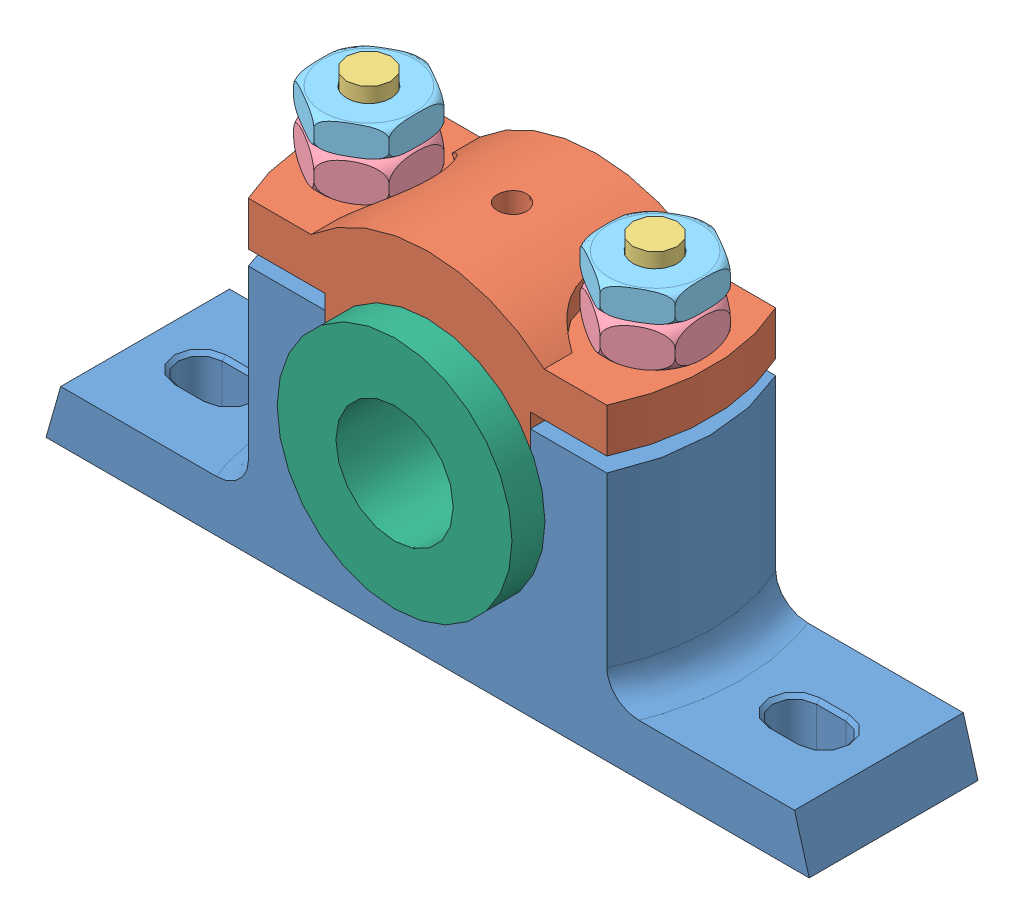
SolidWorks assembly plummer block.SLDASM, configuration Default (file format 11000). Lengths in mm.
Overall size (208 108 64).
9 component instances, 6 part files, 23 mates.
Components (placement in the parent):
- casting-1: casting.SLDPRT [Default] at origin size (208 68 46)
- cap-1: cap.SLDPRT [Default] at (0 48 0) size (108 40 46)
- bolt-1: bolt.SLDPRT [Default] at (-39 12 0) x (0 0 1) z (-1 0 0) size (26.18 105 26.18)
- nut-1: nut.SLDPRT [Default] at (39 84 0) x (0.866025 0 -0.5) z (0.5 0 0.866025) size (31.62 12 27.6)
- lock nut-1: lock nut.SLDPRT [Default] at (-39 100 0) x (0.866025 0 0.5) z (-0.5 0 0.866025) size (31.3 9.54 27.28)
- brasses-1: brasses.SLDPRT [Default] at (0 48 0) x (0 0 -1) z (1 0 0) size (64 64 64)
- bolt-3: bolt.SLDPRT [Default] at (39 12 0) x (-1 0 0) z (0 0 -1) size (26.18 105 26.18)
- nut-2: nut.SLDPRT [Default] at (-39 84 0) x (0.866025 0 0.5) z (-0.5 0 0.866025) size (31.62 12 27.6)
- lock nut-2: lock nut.SLDPRT [Default] at (39 100 0) x (0 0 -1) z (1 0 0) size (31.3 9.54 27.28)
Mates (geometry in assembly coordinates):
- Concentric1: concentric: cylinder of assembly; cylinder of assembly; cylinder of casting-1 through (39 68 0) axis (0 -1 0) radius 6; cylinder of cap-1 through (39 56 0) axis (0 1 0) radius 6
- Concentric3: concentric: cylinder of assembly; cylinder of assembly; cylinder of casting-1 through (0 48 23) axis (0 0 -1) radius 24; cylinder of brasses-1 through (0 48 34.2237) axis (0 0 1) radius 22
- Concentric4: concentric: cylinder of assembly; cylinder of assembly; cylinder of casting-1 through (0 0 0) axis (0 -1 0) radius 4; cylinder of brasses-1 through (0 500048 0) axis (0 -1 0) radius 4
- Concentric5: concentric: cylinder of assembly; cylinder of assembly; cylinder of casting-1 through (-39 68 0) axis (0 -1 0) radius 6; cylinder of cap-1 through (-39 56 0) axis (0 1 0) radius 6
- Concentric7: concentric: cylinder of assembly; cylinder of assembly; cylinder of cap-1 through (0 48 23) axis (0 0 -1) radius 24; cylinder of brasses-1 through (0 48 34.2237) axis (0 0 1) radius 24
- Concentric8: concentric: cylinder of assembly; cylinder of assembly; cylinder of cap-1 through (-39 56 0) axis (0 1 0) radius 6; cylinder of bolt-1 through (-39 108 0) axis (0 -1 0) radius 6
- Coincident9: coincident: plane of assembly; plane of assembly; plane of casting-1 through (-26 12 -13) normal (0 -1 0); plane of bolt-1 through (-51 12 -12) normal (0 1 0)
- Concentric10: concentric: cylinder of assembly; cylinder of assembly; cylinder of cap-1 through (39 56 0) axis (0 1 0) radius 6; cylinder of bolt-3 through (39 108 0) axis (0 -1 0) radius 6
- Parallel1: parallel: plane of assembly; plane of assembly; plane of casting-1 through (26 12 13) normal (1 0 0); plane of bolt-3 through (27 4 12) normal (-1 0 0)
- Coincident10: coincident: plane of assembly; plane of assembly; plane of casting-1 through (26 12 -13) normal (0 -1 0); plane of bolt-3 through (51 12 -12) normal (0 1 0); plane of assembly; plane of assembly; plane of casting-1; plane of bolt-1
- Parallel3: parallel: plane of casting-1 through (-52 12 13) normal (1 0 0); plane of bolt-1 through (-51 4 -12) normal (-1 0 0)
- Concentric11: concentric: cylinder of assembly; cylinder of assembly; cylinder of nut-1 through (39 96 0) axis (0 -1 0) radius 6; cylinder of bolt-3 through (39 108 0) axis (0 -1 0) radius 6
- Coincident11: coincident: plane of assembly; plane of assembly; plane of cap-1 through (54 84 23) normal (0 1 0); plane of nut-1 through (51.9904 84 -22.5) normal (0 -1 0)
- Concentric12: concentric: cylinder of assembly; cylinder of assembly; cylinder of bolt-3 through (39 108 0) axis (0 -1 0) radius 6; cylinder of lock nut-2 through (39 104 0) axis (0 -1 0) radius 6
- Coincident12: coincident: plane of assembly; plane of assembly; plane of nut-1 through (51.9904 96 -22.5) normal (0 1 0); plane of lock nut-2 through (26.0096 96 -22.5) normal (0 -1 0); plane of assembly; plane of nut-1; plane of assembly; plane of assembly; plane of lock nut-2; plane of assembly
- Parallel4: parallel: plane of nut-1 through (51.9904 96 7.5) normal (1 0 0)
- Parallel5: parallel: plane of lock nut-2 through (51.9904 104 7.5) normal (1 0 0)
- Concentric13: concentric: cylinder of assembly; cylinder of assembly; cylinder of bolt-1 through (-39 108 0) axis (0 -1 0) radius 6; cylinder of nut-2 through (-39 96 0) axis (0 -1 0) radius 6
- Coincident14: coincident: plane of assembly; plane of assembly; plane of cap-1 through (-54 84 23) normal (0 1 0); plane of nut-2 through (-13.0192 84 0) normal (0 -1 0)
- Concentric14: concentric: cylinder of assembly; cylinder of assembly; cylinder of bolt-1 through (-39 108 0) axis (0 -1 0) radius 6; cylinder of lock nut-1 through (-39 104 0) axis (0 -1 0) radius 6
- Coincident15: coincident: plane of assembly; plane of assembly; plane of lock nut-1 through (-13.0192 96 0) normal (0 -1 0); plane of nut-2 through (-13.0192 96 0) normal (0 1 0); plane of assembly; plane of nut-2; plane of assembly; plane of assembly; plane of lock nut-1; plane of assembly
- Parallel6: parallel: plane of nut-2 through (-51.9904 96 -7.5) normal (-1 0 0)
- Parallel7: parallel: plane of lock nut-1 through (-51.9904 104 -7.5) normal (-1 0 0)
